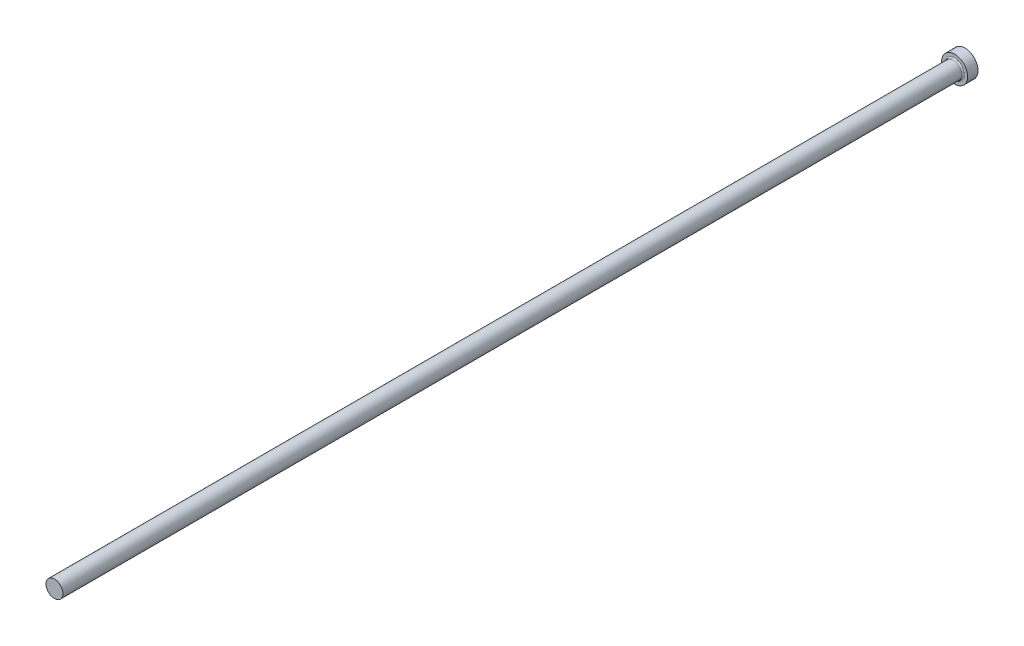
ISO-10303-21;
HEADER;
FILE_DESCRIPTION(('STEP AP214'),'2;1');
FILE_NAME('part.step','',(''),(''),'','','');
FILE_SCHEMA(('AUTOMOTIVE_DESIGN { 1 0 10303 214 1 1 1 1 }'));
ENDSEC;
DATA;
#1=APPLICATION_CONTEXT('core data for automotive mechanical design processes');
#2=APPLICATION_PROTOCOL_DEFINITION('international standard','automotive_design',2000,#1);
#3=PRODUCT_CONTEXT('',#1,'mechanical');
#4=PRODUCT('Part','Part','',(#3));
#5=PRODUCT_RELATED_PRODUCT_CATEGORY('part','',(#4));
#6=PRODUCT_DEFINITION_FORMATION('','',#4);
#7=PRODUCT_DEFINITION_CONTEXT('part definition',#1,'design');
#8=PRODUCT_DEFINITION('design','',#6,#7);
#9=PRODUCT_DEFINITION_SHAPE('','',#8);
#10=(LENGTH_UNIT() NAMED_UNIT(*) SI_UNIT(.MILLI.,.METRE.));
#11=(NAMED_UNIT(*) PLANE_ANGLE_UNIT() SI_UNIT($,.RADIAN.));
#12=(NAMED_UNIT(*) SI_UNIT($,.STERADIAN.) SOLID_ANGLE_UNIT());
#13=UNCERTAINTY_MEASURE_WITH_UNIT(LENGTH_MEASURE(1.E-05),#10,'distance_accuracy_value','');
#14=(GEOMETRIC_REPRESENTATION_CONTEXT(3) GLOBAL_UNCERTAINTY_ASSIGNED_CONTEXT((#13)) GLOBAL_UNIT_ASSIGNED_CONTEXT((#10,
#11,#12)) REPRESENTATION_CONTEXT('',''));
#15=CARTESIAN_POINT('',(0.,0.,0.));
#16=DIRECTION('',(0.,0.,1.));
#17=DIRECTION('',(1.,0.,0.));
#18=AXIS2_PLACEMENT_3D('',#15,#16,#17);
#19=CARTESIAN_POINT('',(5.,0.,4.));
#20=DIRECTION('',(0.,0.,-1.));
#21=DIRECTION('',(-1.,0.,0.));
#22=AXIS2_PLACEMENT_3D('',#19,#20,#21);
#23=PLANE('',#22);
#24=CARTESIAN_POINT('',(0.,0.,4.));
#25=DIRECTION('',(0.,0.,-1.));
#26=DIRECTION('',(-1.,0.,0.));
#27=AXIS2_PLACEMENT_3D('',#24,#25,#26);
#28=CIRCLE('',#27,3.75000000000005);
#29=CARTESIAN_POINT('',(-3.75000000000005,0.,4.));
#30=VERTEX_POINT('',#29);
#31=EDGE_CURVE('E40',#30,#30,#28,.T.);
#32=ORIENTED_EDGE('',*,*,#31,.T.);
#33=EDGE_LOOP('',(#32));
#34=FACE_BOUND('',#33,.T.);
#35=CARTESIAN_POINT('',(0.,0.,4.));
#36=DIRECTION('',(0.,0.,-1.));
#37=DIRECTION('',(-1.,0.,0.));
#38=AXIS2_PLACEMENT_3D('',#35,#36,#37);
#39=CIRCLE('',#38,5.);
#40=CARTESIAN_POINT('',(-5.,0.,4.));
#41=VERTEX_POINT('',#40);
#42=EDGE_CURVE('E44',#41,#41,#39,.T.);
#43=ORIENTED_EDGE('',*,*,#42,.F.);
#44=EDGE_LOOP('',(#43));
#45=FACE_BOUND('',#44,.T.);
#46=ADVANCED_FACE('F33',(#34,#45),#23,.F.);
#47=CARTESIAN_POINT('',(0.,0.,-9.03322817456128));
#48=DIRECTION('',(0.,0.,-1.));
#49=DIRECTION('',(-1.,0.,0.));
#50=AXIS2_PLACEMENT_3D('',#47,#48,#49);
#51=CYLINDRICAL_SURFACE('',#50,5.);
#52=CARTESIAN_POINT('',(0.,0.,0.));
#53=DIRECTION('',(0.,0.,-1.));
#54=DIRECTION('',(-1.,0.,0.));
#55=AXIS2_PLACEMENT_3D('',#52,#53,#54);
#56=CIRCLE('',#55,5.);
#57=CARTESIAN_POINT('',(-5.,0.,0.));
#58=VERTEX_POINT('',#57);
#59=EDGE_CURVE('E48',#58,#58,#56,.T.);
#60=ORIENTED_EDGE('',*,*,#59,.F.);
#61=EDGE_LOOP('',(#60));
#62=FACE_BOUND('',#61,.T.);
#63=ORIENTED_EDGE('',*,*,#42,.T.);
#64=EDGE_LOOP('',(#63));
#65=FACE_BOUND('',#64,.T.);
#66=ADVANCED_FACE('F68',(#62,#65),#51,.T.);
#67=CARTESIAN_POINT('',(0.,0.,0.));
#68=DIRECTION('',(0.,0.,1.));
#69=DIRECTION('',(1.,0.,0.));
#70=AXIS2_PLACEMENT_3D('',#67,#68,#69);
#71=PLANE('',#70);
#72=ORIENTED_EDGE('',*,*,#59,.T.);
#73=EDGE_LOOP('',(#72));
#74=FACE_BOUND('',#73,.T.);
#75=ADVANCED_FACE('F61',(#74),#71,.F.);
#76=CARTESIAN_POINT('',(0.,0.,350.));
#77=DIRECTION('',(0.,0.,-1.));
#78=DIRECTION('',(-1.,0.,0.));
#79=AXIS2_PLACEMENT_3D('',#76,#77,#78);
#80=PLANE('',#79);
#81=CARTESIAN_POINT('',(0.,0.,350.));
#82=DIRECTION('',(0.,0.,-1.));
#83=DIRECTION('',(-1.,0.,0.));
#84=AXIS2_PLACEMENT_3D('',#81,#82,#83);
#85=CIRCLE('',#84,3.25000000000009);
#86=CARTESIAN_POINT('',(-3.25000000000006,0.,350.));
#87=VERTEX_POINT('',#86);
#88=EDGE_CURVE('E53',#87,#87,#85,.T.);
#89=ORIENTED_EDGE('',*,*,#88,.F.);
#90=EDGE_LOOP('',(#89));
#91=FACE_BOUND('',#90,.T.);
#92=ADVANCED_FACE('F59',(#91),#80,.F.);
#93=CARTESIAN_POINT('',(0.,0.,-9.03322817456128));
#94=DIRECTION('',(0.,0.,-1.));
#95=DIRECTION('',(-1.,0.,0.));
#96=AXIS2_PLACEMENT_3D('',#93,#94,#95);
#97=CYLINDRICAL_SURFACE('',#96,3.25000000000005);
#98=CARTESIAN_POINT('',(0.,0.,4.5));
#99=DIRECTION('',(0.,0.,-1.));
#100=DIRECTION('',(-1.,0.,0.));
#101=AXIS2_PLACEMENT_3D('',#98,#99,#100);
#102=CIRCLE('',#101,3.25000000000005);
#103=CARTESIAN_POINT('',(-3.25000000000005,0.,4.5));
#104=VERTEX_POINT('',#103);
#105=EDGE_CURVE('E10',#104,#104,#102,.F.);
#106=ORIENTED_EDGE('',*,*,#105,.T.);
#107=EDGE_LOOP('',(#106));
#108=FACE_BOUND('',#107,.T.);
#109=ORIENTED_EDGE('',*,*,#88,.T.);
#110=EDGE_LOOP('',(#109));
#111=FACE_BOUND('',#110,.T.);
#112=ADVANCED_FACE('F57',(#108,#111),#97,.T.);
#113=CARTESIAN_POINT('',(0.,0.,4.5));
#114=DIRECTION('',(0.,0.,-1.));
#115=DIRECTION('',(-1.,0.,0.));
#116=AXIS2_PLACEMENT_3D('',#113,#114,#115);
#117=TOROIDAL_SURFACE('',#116,3.75000000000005,0.5);
#118=ORIENTED_EDGE('',*,*,#105,.F.);
#119=EDGE_LOOP('',(#118));
#120=FACE_BOUND('',#119,.T.);
#121=ORIENTED_EDGE('',*,*,#31,.F.);
#122=EDGE_LOOP('',(#121));
#123=FACE_BOUND('',#122,.T.);
#124=ADVANCED_FACE('F35',(#120,#123),#117,.F.);
#125=CLOSED_SHELL('',(#46,#66,#75,#92,#112,#124));
#126=MANIFOLD_SOLID_BREP('B2',#125);
#127=ADVANCED_BREP_SHAPE_REPRESENTATION('',(#18,#126),#14);
#128=SHAPE_DEFINITION_REPRESENTATION(#9,#127);
ENDSEC;
END-ISO-10303-21;
